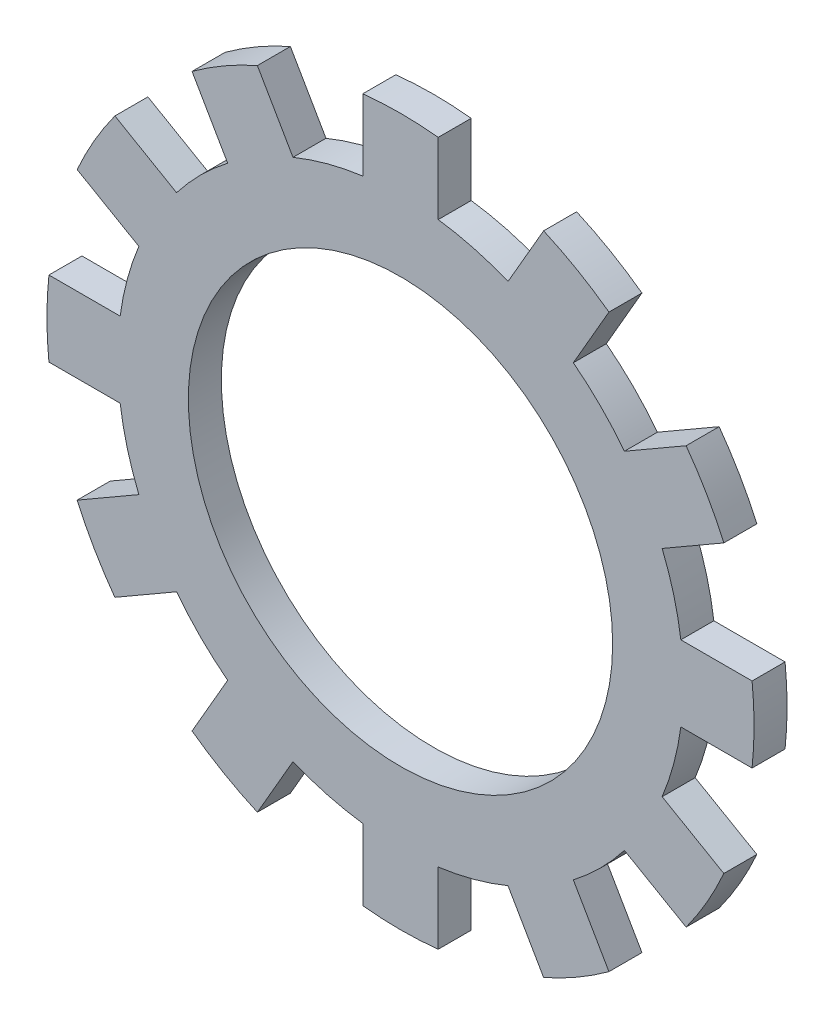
from build123d import *

# Parameters (mm, degrees)
SKETCH1_R                 = 12
SKETCH1_R_2               = 9
BOSS_EXTRUDE1_DEPTH       = 0.7
BOSS_EXTRUDE2_DEPTH       = 0.7
CIRPATTERN2_COUNT         = 12
CIRPATTERN2_COPY_1_DEPTH  = 0.7
CIRPATTERN2_COPY_2_DEPTH  = 0.7
CIRPATTERN2_COPY_3_DEPTH  = 0.7
CIRPATTERN2_COPY_4_DEPTH  = 0.7
CIRPATTERN2_COPY_5_DEPTH  = 0.7
CIRPATTERN2_COPY_6_DEPTH  = 0.7
CIRPATTERN2_COPY_7_DEPTH  = 0.7
CIRPATTERN2_COPY_8_DEPTH  = 0.7
CIRPATTERN2_COPY_9_DEPTH  = 0.7
CIRPATTERN2_COPY_10_DEPTH = 0.7
CIRPATTERN2_COPY_11_DEPTH = 0.7


with BuildPart() as part:
    # Sketch1 → Boss-Extrude1 (new, symmetric)
    with BuildSketch(Plane.XY):
        Circle(SKETCH1_R)
        Circle(SKETCH1_R_2, mode=Mode.SUBTRACT)
    extrude(amount=BOSS_EXTRUDE1_DEPTH, both=True)

    # Sketch3 → Boss-Extrude2 (add, symmetric)
    with BuildSketch(Plane.XY):
        with BuildLine():
            Line((-1.6, 14.91442255), (-1.6, 11.892854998))
            ThreePointArc((-1.6, 11.892854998), (-0.801791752, 11.973183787), (0, 12))
            Line((0, 12), (0, 15))
            ThreePointArc((0, 15), (-0.80114348, 14.978590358), (-1.6, 14.91442255))
        make_face()
    boss_extrude2 = extrude(amount=BOSS_EXTRUDE2_DEPTH, both=True)

    # Mirror1: Boss-Extrude2 across plane
    add(boss_extrude2.mirror(Plane(origin=(0, 0, 0), x_dir=(0, 0, 1), z_dir=(1, 0, 0))))

    # CirPattern2: Boss-Extrude2 ×12 about axis
    cirpattern2_axis = Axis((0, 0, 0), (0, 0, 1))
    for i in range(1, CIRPATTERN2_COUNT):
        add(boss_extrude2.rotate(cirpattern2_axis, i * 360 / CIRPATTERN2_COUNT))

    # CirPattern2 copy 1 sketch → CirPattern2 copy 1 (add, symmetric)
    with BuildSketch(Plane(origin=(0, 0, 0), x_dir=(-0.8660254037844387, -0.49999999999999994, 0), z_dir=(0, 0, 1))):
        with BuildLine():
            Line((-1.6, -14.91442255), (-1.6, -11.892854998))
            ThreePointArc((-1.6, -11.892854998), (-0.801791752, -11.973183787), (0, -12))
            Line((0, -12), (0, -15))
            ThreePointArc((0, -15), (-0.80114348, -14.978590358), (-1.6, -14.91442255))
        make_face()
    extrude(amount=CIRPATTERN2_COPY_1_DEPTH, both=True)

    # CirPattern2 copy 2 sketch → CirPattern2 copy 2 (add, symmetric)
    with BuildSketch(Plane(origin=(0, 0, 0), x_dir=(-0.5000000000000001, -0.8660254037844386, 0), z_dir=(0, 0, 1))):
        with BuildLine():
            Line((-1.6, -14.91442255), (-1.6, -11.892854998))
            ThreePointArc((-1.6, -11.892854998), (-0.801791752, -11.973183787), (0, -12))
            Line((0, -12), (0, -15))
            ThreePointArc((0, -15), (-0.80114348, -14.978590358), (-1.6, -14.91442255))
        make_face()
    extrude(amount=CIRPATTERN2_COPY_2_DEPTH, both=True)

    # CirPattern2 copy 3 sketch → CirPattern2 copy 3 (add, symmetric)
    with BuildSketch(Plane(origin=(0, 0, 0), x_dir=(0, -1, 0), z_dir=(0, 0, 1))):
        with BuildLine():
            Line((-1.6, -14.91442255), (-1.6, -11.892854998))
            ThreePointArc((-1.6, -11.892854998), (-0.801791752, -11.973183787), (0, -12))
            Line((0, -12), (0, -15))
            ThreePointArc((0, -15), (-0.80114348, -14.978590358), (-1.6, -14.91442255))
        make_face()
    extrude(amount=CIRPATTERN2_COPY_3_DEPTH, both=True)

    # CirPattern2 copy 4 sketch → CirPattern2 copy 4 (add, symmetric)
    with BuildSketch(Plane(origin=(0, 0, 0), x_dir=(0.4999999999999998, -0.8660254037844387, 0), z_dir=(0, 0, 1))):
        with BuildLine():
            Line((-1.6, -14.91442255), (-1.6, -11.892854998))
            ThreePointArc((-1.6, -11.892854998), (-0.801791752, -11.973183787), (0, -12))
            Line((0, -12), (0, -15))
            ThreePointArc((0, -15), (-0.80114348, -14.978590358), (-1.6, -14.91442255))
        make_face()
    extrude(amount=CIRPATTERN2_COPY_4_DEPTH, both=True)

    # CirPattern2 copy 5 sketch → CirPattern2 copy 5 (add, symmetric)
    with BuildSketch(Plane(origin=(0, 0, 0), x_dir=(0.8660254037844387, -0.49999999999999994, 0), z_dir=(0, 0, 1))):
        with BuildLine():
            Line((-1.6, -14.91442255), (-1.6, -11.892854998))
            ThreePointArc((-1.6, -11.892854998), (-0.801791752, -11.973183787), (0, -12))
            Line((0, -12), (0, -15))
            ThreePointArc((0, -15), (-0.80114348, -14.978590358), (-1.6, -14.91442255))
        make_face()
    extrude(amount=CIRPATTERN2_COPY_5_DEPTH, both=True)

    # CirPattern2 copy 6 sketch → CirPattern2 copy 6 (add, symmetric)
    with BuildSketch(Plane.XY):
        with BuildLine():
            Line((-1.6, -14.91442255), (-1.6, -11.892854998))
            ThreePointArc((-1.6, -11.892854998), (-0.801791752, -11.973183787), (0, -12))
            Line((0, -12), (0, -15))
            ThreePointArc((0, -15), (-0.80114348, -14.978590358), (-1.6, -14.91442255))
        make_face()
    extrude(amount=CIRPATTERN2_COPY_6_DEPTH, both=True)

    # CirPattern2 copy 7 sketch → CirPattern2 copy 7 (add, symmetric)
    with BuildSketch(Plane(origin=(0, 0, 0), x_dir=(0.8660254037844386, 0.5000000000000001, 0), z_dir=(0, 0, 1))):
        with BuildLine():
            Line((-1.6, -14.91442255), (-1.6, -11.892854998))
            ThreePointArc((-1.6, -11.892854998), (-0.801791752, -11.973183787), (0, -12))
            Line((0, -12), (0, -15))
            ThreePointArc((0, -15), (-0.80114348, -14.978590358), (-1.6, -14.91442255))
        make_face()
    extrude(amount=CIRPATTERN2_COPY_7_DEPTH, both=True)

    # CirPattern2 copy 8 sketch → CirPattern2 copy 8 (add, symmetric)
    with BuildSketch(Plane(origin=(0, 0, 0), x_dir=(0.5000000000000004, 0.8660254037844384, 0), z_dir=(0, 0, 1))):
        with BuildLine():
            Line((-1.6, -14.91442255), (-1.6, -11.892854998))
            ThreePointArc((-1.6, -11.892854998), (-0.801791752, -11.973183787), (0, -12))
            Line((0, -12), (0, -15))
            ThreePointArc((0, -15), (-0.80114348, -14.978590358), (-1.6, -14.91442255))
        make_face()
    extrude(amount=CIRPATTERN2_COPY_8_DEPTH, both=True)

    # CirPattern2 copy 9 sketch → CirPattern2 copy 9 (add, symmetric)
    with BuildSketch(Plane(origin=(0, 0, 0), x_dir=(0, 1, 0), z_dir=(0, 0, 1))):
        with BuildLine():
            Line((-1.6, -14.91442255), (-1.6, -11.892854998))
            ThreePointArc((-1.6, -11.892854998), (-0.801791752, -11.973183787), (0, -12))
            Line((0, -12), (0, -15))
            ThreePointArc((0, -15), (-0.80114348, -14.978590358), (-1.6, -14.91442255))
        make_face()
    extrude(amount=CIRPATTERN2_COPY_9_DEPTH, both=True)

    # CirPattern2 copy 10 sketch → CirPattern2 copy 10 (add, symmetric)
    with BuildSketch(Plane(origin=(0, 0, 0), x_dir=(-0.5000000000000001, 0.8660254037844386, 0), z_dir=(0, 0, 1))):
        with BuildLine():
            Line((-1.6, -14.91442255), (-1.6, -11.892854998))
            ThreePointArc((-1.6, -11.892854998), (-0.801791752, -11.973183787), (0, -12))
            Line((0, -12), (0, -15))
            ThreePointArc((0, -15), (-0.80114348, -14.978590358), (-1.6, -14.91442255))
        make_face()
    extrude(amount=CIRPATTERN2_COPY_10_DEPTH, both=True)

    # CirPattern2 copy 11 sketch → CirPattern2 copy 11 (add, symmetric)
    with BuildSketch(Plane(origin=(0, 0, 0), x_dir=(-0.8660254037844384, 0.5000000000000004, 0), z_dir=(0, 0, 1))):
        with BuildLine():
            Line((-1.6, -14.91442255), (-1.6, -11.892854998))
            ThreePointArc((-1.6, -11.892854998), (-0.801791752, -11.973183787), (0, -12))
            Line((0, -12), (0, -15))
            ThreePointArc((0, -15), (-0.80114348, -14.978590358), (-1.6, -14.91442255))
        make_face()
    extrude(amount=CIRPATTERN2_COPY_11_DEPTH, both=True)


solid = part.part
